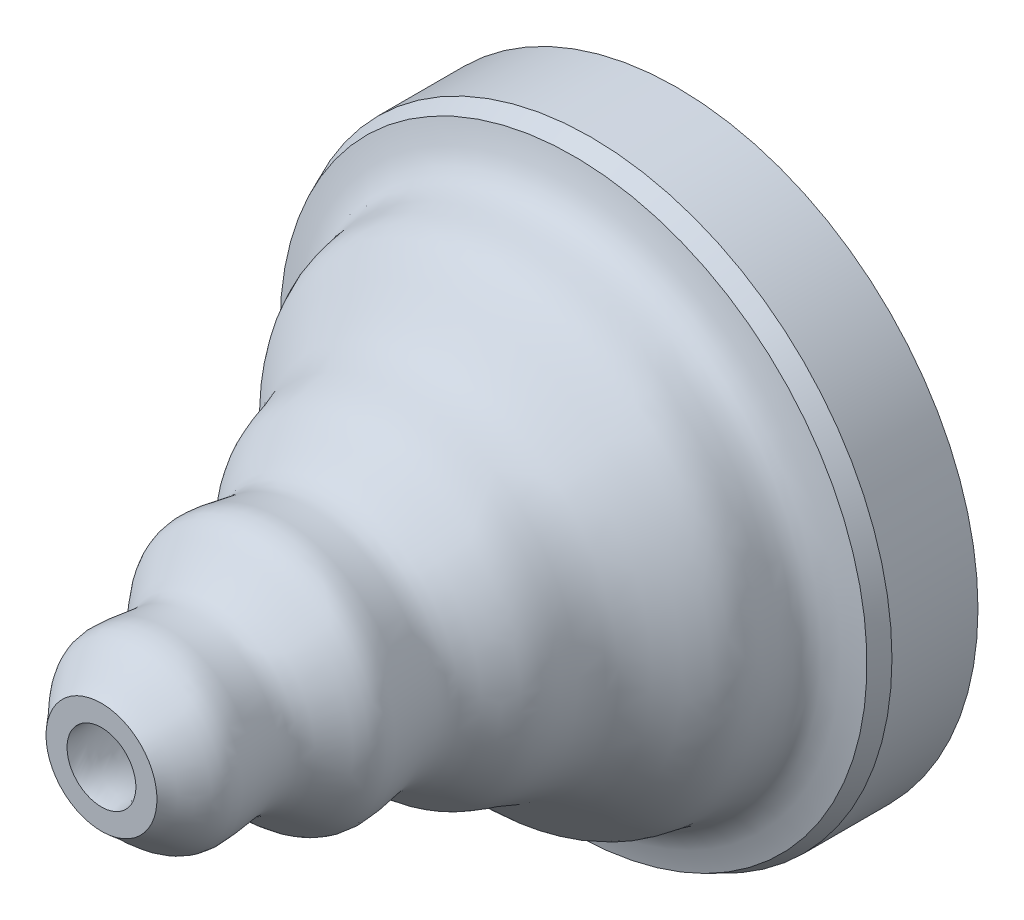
ISO-10303-21;
HEADER;
FILE_DESCRIPTION(('STEP AP214'),'2;1');
FILE_NAME('part.step','',(''),(''),'','','');
FILE_SCHEMA(('AUTOMOTIVE_DESIGN { 1 0 10303 214 1 1 1 1 }'));
ENDSEC;
DATA;
#1=APPLICATION_CONTEXT('core data for automotive mechanical design processes');
#2=APPLICATION_PROTOCOL_DEFINITION('international standard','automotive_design',2000,#1);
#3=PRODUCT_CONTEXT('',#1,'mechanical');
#4=PRODUCT('Part','Part','',(#3));
#5=PRODUCT_RELATED_PRODUCT_CATEGORY('part','',(#4));
#6=PRODUCT_DEFINITION_FORMATION('','',#4);
#7=PRODUCT_DEFINITION_CONTEXT('part definition',#1,'design');
#8=PRODUCT_DEFINITION('design','',#6,#7);
#9=PRODUCT_DEFINITION_SHAPE('','',#8);
#10=(LENGTH_UNIT() NAMED_UNIT(*) SI_UNIT(.MILLI.,.METRE.));
#11=(NAMED_UNIT(*) PLANE_ANGLE_UNIT() SI_UNIT($,.RADIAN.));
#12=(NAMED_UNIT(*) SI_UNIT($,.STERADIAN.) SOLID_ANGLE_UNIT());
#13=UNCERTAINTY_MEASURE_WITH_UNIT(LENGTH_MEASURE(1.E-05),#10,'distance_accuracy_value','');
#14=(GEOMETRIC_REPRESENTATION_CONTEXT(3) GLOBAL_UNCERTAINTY_ASSIGNED_CONTEXT((#13)) GLOBAL_UNIT_ASSIGNED_CONTEXT((#10,
#11,#12)) REPRESENTATION_CONTEXT('',''));
#15=CARTESIAN_POINT('',(0.,0.,0.));
#16=DIRECTION('',(0.,0.,1.));
#17=DIRECTION('',(1.,0.,0.));
#18=AXIS2_PLACEMENT_3D('',#15,#16,#17);
#19=CARTESIAN_POINT('',(0.,0.,33.45));
#20=DIRECTION('',(0.,0.,1.));
#21=DIRECTION('',(1.,0.,0.));
#22=AXIS2_PLACEMENT_3D('',#19,#20,#21);
#23=PLANE('',#22);
#24=CARTESIAN_POINT('',(0.,0.,33.45));
#25=DIRECTION('',(0.,0.,1.));
#26=DIRECTION('',(1.,0.,0.));
#27=AXIS2_PLACEMENT_3D('',#24,#25,#26);
#28=CIRCLE('',#27,2.);
#29=CARTESIAN_POINT('',(-1.94648615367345,0.459555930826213,33.45));
#30=VERTEX_POINT('',#29);
#31=EDGE_CURVE('E57',#30,#30,#28,.T.);
#32=ORIENTED_EDGE('',*,*,#31,.F.);
#33=EDGE_LOOP('',(#32));
#34=FACE_BOUND('',#33,.T.);
#35=CARTESIAN_POINT('',(0.,0.,33.45));
#36=DIRECTION('',(0.,0.,-1.));
#37=DIRECTION('',(-1.,0.,0.));
#38=AXIS2_PLACEMENT_3D('',#35,#36,#37);
#39=CIRCLE('',#38,3.22373729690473);
#40=CARTESIAN_POINT('',(-3.22373729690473,0.,33.45));
#41=VERTEX_POINT('',#40);
#42=EDGE_CURVE('E148',#41,#41,#39,.T.);
#43=ORIENTED_EDGE('',*,*,#42,.F.);
#44=EDGE_LOOP('',(#43));
#45=FACE_BOUND('',#44,.T.);
#46=ADVANCED_FACE('F37',(#34,#45),#23,.T.);
#47=CARTESIAN_POINT('',(0.,0.,33.45));
#48=DIRECTION('',(0.,0.,-1.));
#49=DIRECTION('',(-1.,0.,0.));
#50=AXIS2_PLACEMENT_3D('',#47,#48,#49);
#51=CONICAL_SURFACE('',#50,5.,0.413976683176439);
#52=CARTESIAN_POINT('',(0.,0.,5.));
#53=DIRECTION('',(0.,0.,-1.));
#54=DIRECTION('',(-1.,0.,0.));
#55=AXIS2_PLACEMENT_3D('',#52,#53,#54);
#56=CIRCLE('',#55,17.5);
#57=CARTESIAN_POINT('',(-17.5,0.,5.));
#58=VERTEX_POINT('',#57);
#59=EDGE_CURVE('E11',#58,#58,#56,.F.);
#60=ORIENTED_EDGE('',*,*,#59,.T.);
#61=EDGE_LOOP('',(#60));
#62=FACE_BOUND('',#61,.T.);
#63=CARTESIAN_POINT('',(0.,0.,6.00946363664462));
#64=DIRECTION('',(0.,0.,-1.));
#65=DIRECTION('',(-1.,0.,0.));
#66=AXIS2_PLACEMENT_3D('',#63,#64,#65);
#67=CIRCLE('',#66,17.0564746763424);
#68=CARTESIAN_POINT('',(-17.0564746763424,0.,6.00946363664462));
#69=VERTEX_POINT('',#68);
#70=EDGE_CURVE('E63',#69,#69,#67,.T.);
#71=ORIENTED_EDGE('',*,*,#70,.T.);
#72=EDGE_LOOP('',(#71));
#73=FACE_BOUND('',#72,.T.);
#74=ADVANCED_FACE('F87',(#62,#73),#51,.T.);
#75=CARTESIAN_POINT('',(0.,0.,0.));
#76=DIRECTION('',(0.,0.,1.));
#77=DIRECTION('',(1.,0.,0.));
#78=AXIS2_PLACEMENT_3D('',#75,#76,#77);
#79=PLANE('',#78);
#80=CARTESIAN_POINT('',(0.,0.,0.));
#81=DIRECTION('',(0.,0.,1.));
#82=DIRECTION('',(1.,0.,0.));
#83=AXIS2_PLACEMENT_3D('',#80,#81,#82);
#84=CIRCLE('',#83,17.5);
#85=CARTESIAN_POINT('',(17.5,0.,0.));
#86=VERTEX_POINT('',#85);
#87=EDGE_CURVE('E45',#86,#86,#84,.T.);
#88=ORIENTED_EDGE('',*,*,#87,.F.);
#89=EDGE_LOOP('',(#88));
#90=FACE_BOUND('',#89,.T.);
#91=CARTESIAN_POINT('',(0.,0.,0.));
#92=DIRECTION('',(0.,0.,1.));
#93=DIRECTION('',(1.,0.,0.));
#94=AXIS2_PLACEMENT_3D('',#91,#92,#93);
#95=CIRCLE('',#94,12.5);
#96=CARTESIAN_POINT('',(12.5,0.,0.));
#97=VERTEX_POINT('',#96);
#98=EDGE_CURVE('E49',#97,#97,#95,.T.);
#99=ORIENTED_EDGE('',*,*,#98,.T.);
#100=EDGE_LOOP('',(#99));
#101=FACE_BOUND('',#100,.T.);
#102=ADVANCED_FACE('F90',(#90,#101),#79,.F.);
#103=CARTESIAN_POINT('',(0.,0.,5.));
#104=DIRECTION('',(0.,0.,-1.));
#105=DIRECTION('',(-1.,0.,0.));
#106=AXIS2_PLACEMENT_3D('',#103,#104,#105);
#107=CYLINDRICAL_SURFACE('',#106,17.5);
#108=ORIENTED_EDGE('',*,*,#59,.F.);
#109=EDGE_LOOP('',(#108));
#110=FACE_BOUND('',#109,.T.);
#111=ORIENTED_EDGE('',*,*,#87,.T.);
#112=EDGE_LOOP('',(#111));
#113=FACE_BOUND('',#112,.T.);
#114=ADVANCED_FACE('F39',(#110,#113),#107,.T.);
#115=CARTESIAN_POINT('',(0.,0.,5.));
#116=DIRECTION('',(0.,0.,-1.));
#117=DIRECTION('',(-1.,0.,0.));
#118=AXIS2_PLACEMENT_3D('',#115,#116,#117);
#119=CYLINDRICAL_SURFACE('',#118,12.5);
#120=CARTESIAN_POINT('',(0.,0.,5.));
#121=DIRECTION('',(0.,0.,-1.));
#122=DIRECTION('',(-1.,0.,0.));
#123=AXIS2_PLACEMENT_3D('',#120,#121,#122);
#124=CIRCLE('',#123,12.5);
#125=CARTESIAN_POINT('',(-12.5,0.,5.));
#126=VERTEX_POINT('',#125);
#127=EDGE_CURVE('E54',#126,#126,#124,.T.);
#128=ORIENTED_EDGE('',*,*,#127,.F.);
#129=EDGE_LOOP('',(#128));
#130=FACE_BOUND('',#129,.T.);
#131=ORIENTED_EDGE('',*,*,#98,.F.);
#132=EDGE_LOOP('',(#131));
#133=FACE_BOUND('',#132,.T.);
#134=ADVANCED_FACE('F81',(#130,#133),#119,.F.);
#135=CARTESIAN_POINT('',(0.,0.,5.));
#136=DIRECTION('',(0.,0.,-1.));
#137=DIRECTION('',(-1.,0.,0.));
#138=AXIS2_PLACEMENT_3D('',#135,#136,#137);
#139=PLANE('',#138);
#140=ORIENTED_EDGE('',*,*,#127,.T.);
#141=EDGE_LOOP('',(#140));
#142=FACE_BOUND('',#141,.T.);
#143=CARTESIAN_POINT('',(0.,0.,5.));
#144=DIRECTION('',(0.,0.,-1.));
#145=DIRECTION('',(-1.,0.,0.));
#146=AXIS2_PLACEMENT_3D('',#143,#144,#145);
#147=CIRCLE('',#146,15.);
#148=CARTESIAN_POINT('',(3.55664166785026,14.5722441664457,5.));
#149=VERTEX_POINT('',#148);
#150=EDGE_CURVE('E60',#149,#149,#147,.T.);
#151=ORIENTED_EDGE('',*,*,#150,.F.);
#152=EDGE_LOOP('',(#151));
#153=FACE_BOUND('',#152,.T.);
#154=ADVANCED_FACE('F70',(#142,#153),#139,.F.);
#155=CARTESIAN_POINT('',(-1.94648615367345,0.459555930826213,33.45));
#156=CARTESIAN_POINT('',(3.55664166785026,14.5722441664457,5.));
#157=CARTESIAN_POINT('',(-1.02737429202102,4.35252823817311,33.45));
#158=CARTESIAN_POINT('',(32.7011300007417,7.45896083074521,5.));
#159=CARTESIAN_POINT('',(2.86559801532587,3.43341637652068,33.45));
#160=CARTESIAN_POINT('',(25.5878466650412,-21.6855275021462,5.));
#161=CARTESIAN_POINT('',(1.94648615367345,-0.459555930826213,33.45));
#162=CARTESIAN_POINT('',(-3.55664166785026,-14.5722441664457,5.));
#163=CARTESIAN_POINT('',(1.02737429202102,-4.35252823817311,33.45));
#164=CARTESIAN_POINT('',(-32.7011300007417,-7.4589608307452,5.));
#165=CARTESIAN_POINT('',(-2.86559801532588,-3.43341637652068,33.45));
#166=CARTESIAN_POINT('',(-25.5878466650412,21.6855275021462,5.));
#167=CARTESIAN_POINT('',(-1.94648615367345,0.459555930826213,33.45));
#168=CARTESIAN_POINT('',(3.55664166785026,14.5722441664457,5.));
#169=(BOUNDED_SURFACE() B_SPLINE_SURFACE(3,1,((#155,#156),(#157,#158),(#159,#160),(#161,#162),
(#163,#164),(#165,#166),(#167,#168)),.UNSPECIFIED.,.T.,.F.,.F.) B_SPLINE_SURFACE_WITH_KNOTS((4,
3,4),(2,2),(0.,0.5,1.),(0.,1.),
.UNSPECIFIED.) GEOMETRIC_REPRESENTATION_ITEM() RATIONAL_B_SPLINE_SURFACE(((1.,1.),
(0.333333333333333,0.333333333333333),(0.333333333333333,0.333333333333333),(1.,1.),
(0.333333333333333,0.333333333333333),(0.333333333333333,0.333333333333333),(1.,1.))) REPRESENTATION_ITEM('') SURFACE());
#170=CARTESIAN_POINT('',(-1.94648615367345,0.459555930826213,33.45));
#171=CARTESIAN_POINT('',(-1.88916190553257,0.606563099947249,33.1536458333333));
#172=CARTESIAN_POINT('',(-1.8318376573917,0.753570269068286,32.8572916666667));
#173=CARTESIAN_POINT('',(-1.71718916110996,1.04758460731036,32.2645833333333));
#174=CARTESIAN_POINT('',(-1.65986491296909,1.1945917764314,31.9682291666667));
#175=CARTESIAN_POINT('',(-1.54521641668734,1.48860611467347,31.3755208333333));
#176=CARTESIAN_POINT('',(-1.48789216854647,1.63561328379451,31.0791666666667));
#177=CARTESIAN_POINT('',(-1.37324367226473,1.92962762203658,30.4864583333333));
#178=CARTESIAN_POINT('',(-1.31591942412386,2.07663479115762,30.1901041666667));
#179=CARTESIAN_POINT('',(-1.20127092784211,2.37064912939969,29.5973958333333));
#180=CARTESIAN_POINT('',(-1.14394667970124,2.51765629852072,29.3010416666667));
#181=CARTESIAN_POINT('',(-1.0292981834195,2.8116706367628,28.7083333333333));
#182=CARTESIAN_POINT('',(-0.971973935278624,2.95867780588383,28.4119791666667));
#183=CARTESIAN_POINT('',(-0.85732543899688,3.25269214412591,27.8192708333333));
#184=CARTESIAN_POINT('',(-0.800001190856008,3.39969931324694,27.5229166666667));
#185=CARTESIAN_POINT('',(-0.685352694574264,3.69371365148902,26.9302083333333));
#186=CARTESIAN_POINT('',(-0.628028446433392,3.84072082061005,26.6338541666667));
#187=CARTESIAN_POINT('',(-0.513379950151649,4.13473515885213,26.0411458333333));
#188=CARTESIAN_POINT('',(-0.456055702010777,4.28174232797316,25.7447916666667));
#189=CARTESIAN_POINT('',(-0.341407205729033,4.57575666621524,25.1520833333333));
#190=CARTESIAN_POINT('',(-0.284082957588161,4.72276383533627,24.8557291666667));
#191=CARTESIAN_POINT('',(-0.169434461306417,5.01677817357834,24.2630208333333));
#192=CARTESIAN_POINT('',(-0.112110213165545,5.16378534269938,23.9666666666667));
#193=CARTESIAN_POINT('',(0.00253828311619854,5.45779968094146,23.3739583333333));
#194=CARTESIAN_POINT('',(0.0598625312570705,5.60480685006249,23.0776041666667));
#195=CARTESIAN_POINT('',(0.174511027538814,5.89882118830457,22.4848958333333));
#196=CARTESIAN_POINT('',(0.231835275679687,6.0458283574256,22.1885416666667));
#197=CARTESIAN_POINT('',(0.34648377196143,6.33984269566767,21.5958333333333));
#198=CARTESIAN_POINT('',(0.403808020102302,6.48684986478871,21.2994791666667));
#199=CARTESIAN_POINT('',(0.518456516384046,6.78086420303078,20.7067708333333));
#200=CARTESIAN_POINT('',(0.575780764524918,6.92787137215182,20.4104166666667));
#201=CARTESIAN_POINT('',(0.690429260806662,7.22188571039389,19.8177083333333));
#202=CARTESIAN_POINT('',(0.747753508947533,7.36889287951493,19.5213541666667));
#203=CARTESIAN_POINT('',(0.862402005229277,7.662907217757,18.9286458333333));
#204=CARTESIAN_POINT('',(0.919726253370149,7.80991438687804,18.6322916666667));
#205=CARTESIAN_POINT('',(1.03437474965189,8.10392872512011,18.0395833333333));
#206=CARTESIAN_POINT('',(1.09169899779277,8.25093589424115,17.7432291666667));
#207=CARTESIAN_POINT('',(1.20634749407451,8.54495023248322,17.1505208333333));
#208=CARTESIAN_POINT('',(1.26367174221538,8.69195740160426,16.8541666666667));
#209=CARTESIAN_POINT('',(1.37832023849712,8.98597173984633,16.2614583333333));
#210=CARTESIAN_POINT('',(1.435644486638,9.13297890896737,15.9651041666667));
#211=CARTESIAN_POINT('',(1.55029298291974,9.42699324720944,15.3723958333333));
#212=CARTESIAN_POINT('',(1.60761723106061,9.57400041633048,15.0760416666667));
#213=CARTESIAN_POINT('',(1.72226572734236,9.86801475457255,14.4833333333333));
#214=CARTESIAN_POINT('',(1.77958997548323,10.0150219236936,14.1869791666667));
#215=CARTESIAN_POINT('',(1.89423847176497,10.3090362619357,13.5942708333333));
#216=CARTESIAN_POINT('',(1.95156271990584,10.4560434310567,13.2979166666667));
#217=CARTESIAN_POINT('',(2.06621121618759,10.7500577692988,12.7052083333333));
#218=CARTESIAN_POINT('',(2.12353546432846,10.8970649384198,12.4088541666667));
#219=CARTESIAN_POINT('',(2.2381839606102,11.1910792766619,11.8161458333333));
#220=CARTESIAN_POINT('',(2.29550820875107,11.3380864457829,11.5197916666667));
#221=CARTESIAN_POINT('',(2.41015670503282,11.632100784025,10.9270833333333));
#222=CARTESIAN_POINT('',(2.46748095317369,11.779107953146,10.6307291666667));
#223=CARTESIAN_POINT('',(2.58212944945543,12.0731222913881,10.0380208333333));
#224=CARTESIAN_POINT('',(2.63945369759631,12.2201294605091,9.74166666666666));
#225=CARTESIAN_POINT('',(2.75410219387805,12.5141437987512,9.14895833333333));
#226=CARTESIAN_POINT('',(2.81142644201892,12.6611509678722,8.85260416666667));
#227=CARTESIAN_POINT('',(2.92607493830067,12.9551653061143,8.25989583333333));
#228=CARTESIAN_POINT('',(2.98339918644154,13.1021724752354,7.96354166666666));
#229=CARTESIAN_POINT('',(3.09804768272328,13.3961868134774,7.37083333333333));
#230=CARTESIAN_POINT('',(3.15537193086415,13.5431939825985,7.07447916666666));
#231=CARTESIAN_POINT('',(3.2700204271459,13.8372083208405,6.48177083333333));
#232=CARTESIAN_POINT('',(3.32734467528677,13.9842154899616,6.18541666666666));
#233=CARTESIAN_POINT('',(3.44199317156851,14.2782298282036,5.59270833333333));
#234=CARTESIAN_POINT('',(3.49931741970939,14.4252369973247,5.29635416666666));
#235=CARTESIAN_POINT('',(3.55664166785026,14.5722441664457,5.));
#236=B_SPLINE_CURVE_WITH_KNOTS('',3,(#170,#171,#172,#173,#174,#175,#176,#177,#178,#179,#180,
#181,#182,#183,#184,#185,#186,#187,#188,#189,#190,#191,#192,#193,#194,#195,#196,#197,#198,#199,
#200,#201,#202,#203,#204,#205,#206,#207,#208,#209,#210,#211,#212,#213,#214,#215,#216,#217,#218,
#219,#220,#221,#222,#223,#224,#225,#226,#227,#228,#229,#230,#231,#232,#233,#234,#235),
.UNSPECIFIED.,.F.,.F.,(4,2,2,2,2,2,2,2,2,2,2,2,2,2,2,2,2,2,2,2,2,2,2,2,2,2,2,2,2,2,2,2,4),(0.,
1.00722724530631,2.01445449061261,3.02168173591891,4.02890898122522,5.03613622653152,
6.04336347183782,7.05059071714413,8.05781796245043,9.06504520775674,10.072272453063,
11.0794996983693,12.0867269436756,13.093954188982,14.1011814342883,15.1084086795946,
16.1156359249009,17.1228631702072,18.1300904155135,19.1373176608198,20.1445449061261,
21.1517721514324,22.1589993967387,23.166226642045,24.1734538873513,25.1806811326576,
26.1879083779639,27.1951356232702,28.2023628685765,29.2095901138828,30.2168173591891,
31.2240446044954,32.2312718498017),.UNSPECIFIED.);
#237=EDGE_CURVE('BSEAM80',#30,#149,#236,.T.);
#238=ORIENTED_EDGE('',*,*,#31,.T.);
#239=ORIENTED_EDGE('',*,*,#150,.T.);
#240=ORIENTED_EDGE('',*,*,#237,.T.);
#241=ORIENTED_EDGE('',*,*,#237,.F.);
#242=EDGE_LOOP('',(#238,#240,#239,#241));
#243=FACE_BOUND('',#242,.T.);
#244=ADVANCED_FACE('F80',(#243),#169,.F.);
#245=CARTESIAN_POINT('',(17.0564746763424,0.,6.00946363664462));
#246=CARTESIAN_POINT('',(16.0848824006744,0.,6.25736883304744));
#247=CARTESIAN_POINT('',(14.0411723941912,0.,6.77882865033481));
#248=CARTESIAN_POINT('',(14.2880601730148,0.,9.86359421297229));
#249=CARTESIAN_POINT('',(12.3468165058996,0.,12.0525743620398));
#250=CARTESIAN_POINT('',(9.82676362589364,0.,14.0313994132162));
#251=CARTESIAN_POINT('',(9.58206274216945,0.,17.8916343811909));
#252=CARTESIAN_POINT('',(6.0299471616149,0.,20.3282238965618));
#253=CARTESIAN_POINT('',(8.38212603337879,0.,24.6553648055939));
#254=CARTESIAN_POINT('',(3.8955430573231,0.,26.952384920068));
#255=CARTESIAN_POINT('',(6.09088268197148,0.,31.0684102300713));
#256=CARTESIAN_POINT('',(3.69839817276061,0.,32.7375885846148));
#257=CARTESIAN_POINT('',(3.22373729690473,0.,33.45));
#258=B_SPLINE_CURVE_WITH_KNOTS('',3,(#245,#246,#247,#248,#249,#250,#251,#252,#253,#254,#255,
#256,#257),.UNSPECIFIED.,.F.,.F.,(4,1,1,1,1,1,1,1,1,1,4),(0.,0.0322755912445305,
0.0678905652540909,0.0916033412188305,0.136910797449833,0.177983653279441,0.222384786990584,
0.267230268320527,0.311587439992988,0.357588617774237,0.394053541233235),.UNSPECIFIED.);
#259=CARTESIAN_POINT('',(0.,0.,5.));
#260=DIRECTION('',(0.,0.,-1.));
#261=AXIS1_PLACEMENT('',#259,#260);
#262=SURFACE_OF_REVOLUTION('',#258,#261);
#263=ORIENTED_EDGE('',*,*,#42,.T.);
#264=EDGE_LOOP('',(#263));
#265=FACE_BOUND('',#264,.T.);
#266=ORIENTED_EDGE('',*,*,#70,.F.);
#267=EDGE_LOOP('',(#266));
#268=FACE_BOUND('',#267,.T.);
#269=ADVANCED_FACE('F124',(#265,#268),#262,.F.);
#270=CLOSED_SHELL('',(#46,#74,#102,#114,#134,#154,#244,#269));
#271=MANIFOLD_SOLID_BREP('B2',#270);
#272=ADVANCED_BREP_SHAPE_REPRESENTATION('',(#18,#271),#14);
#273=SHAPE_DEFINITION_REPRESENTATION(#9,#272);
ENDSEC;
END-ISO-10303-21;
